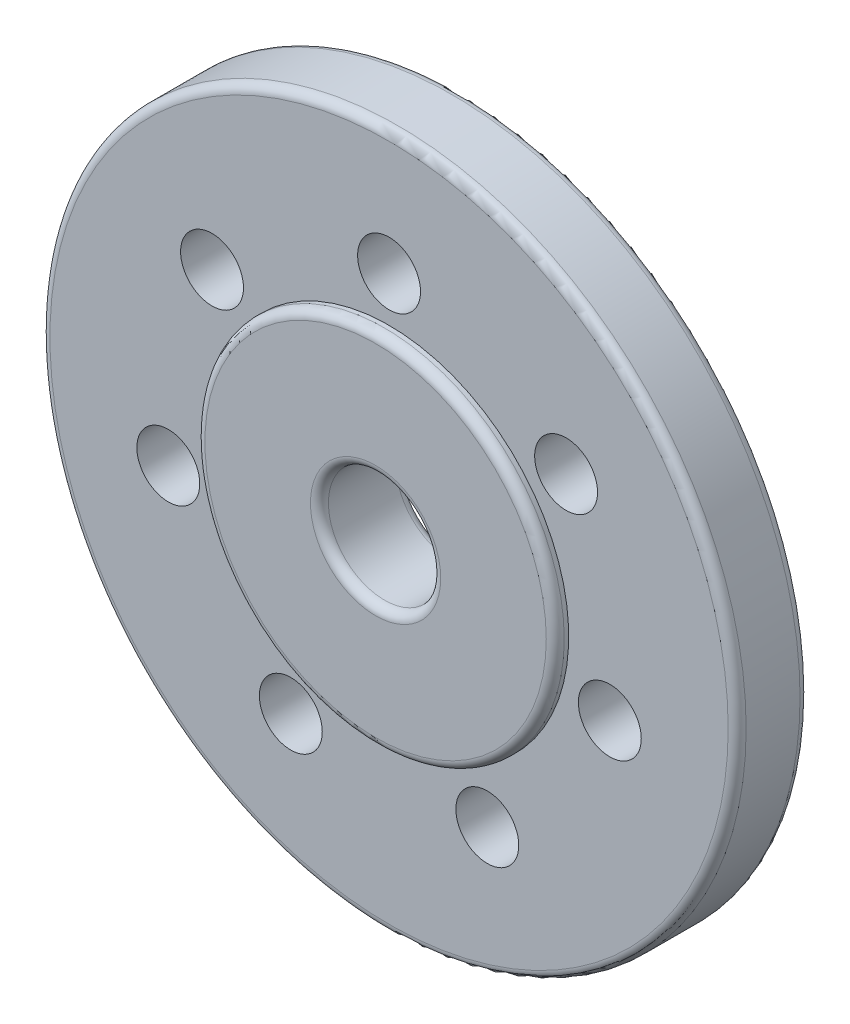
from build123d import *

# Parameters (mm, degrees)
SKETCH1_R           = 98.425
BOSS_EXTRUDE1_DEPTH = 20.32
SKETCH2_R           = 8.89
CUT_EXTRUDE1_DEPTH  = 26.67
CIRPATTERN1_COUNT   = 7
FILLET1_R           = 2.54
SKETCH6_R           = 15.875
CUT_EXTRUDE2_DEPTH  = 141.669341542
BOSS_EXTRUDE2_START = 3.81
SKETCH8_R           = 50.8
SKETCH8_R_2         = 15.875
BOSS_EXTRUDE2_DEPTH = 3.81
FILLET2_R           = 2.54


with BuildPart() as part:
    # Sketch1 → Boss-Extrude1 (new body)
    with BuildSketch(Plane.XY):
        Circle(SKETCH1_R)
    extrude(amount=BOSS_EXTRUDE1_DEPTH)

    # Sketch2 → Cut-Extrude1 (cut)
    with BuildSketch(Plane.XY.offset(20.32)):
        with Locations((0, 63.5)):
            Circle(SKETCH2_R)
    cut_extrude1 = extrude(amount=-CUT_EXTRUDE1_DEPTH, mode=Mode.SUBTRACT)

    # CirPattern1: Cut-Extrude1 ×7 about axis
    cirpattern1_axis = Axis((0, -0.522304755, 0), (0, 0, 1))
    for i in range(1, CIRPATTERN1_COUNT):
        add(cut_extrude1.rotate(cirpattern1_axis, i * 360 / CIRPATTERN1_COUNT), mode=Mode.SUBTRACT)

    # Fillet1
    fillet1_edges = [part.edges().sort_by_distance(p)[0] for p in [
        (-98.425, 0, 0),
        (-98.425, 0, 20.32),
    ]]
    fillet(fillet1_edges, radius=FILLET1_R)

    # Sketch6 → Cut-Extrude2 (cut, through all)
    with BuildSketch(Plane.XY.offset(20.32)):
        Circle(SKETCH6_R)
    extrude(amount=-CUT_EXTRUDE2_DEPTH, mode=Mode.SUBTRACT)

    # Sketch8 → Boss-Extrude2 (add)
    with BuildSketch(Plane.XY.offset(20.32).offset(BOSS_EXTRUDE2_START)):
        with Locations(Location((0, 0, 0), (0, 0, 180))):
            Circle(SKETCH8_R)
        Circle(SKETCH8_R_2, mode=Mode.SUBTRACT)
    extrude(amount=-BOSS_EXTRUDE2_DEPTH)

    # Fillet2
    fillet2_edges = [part.edges().sort_by_distance(p)[0] for p in [
        (-15.875, 0, 0),
        (50.8, 0, 24.13),
        (-15.875, 0, 24.13),
    ]]
    fillet(fillet2_edges, radius=FILLET2_R)


solid = part.part
